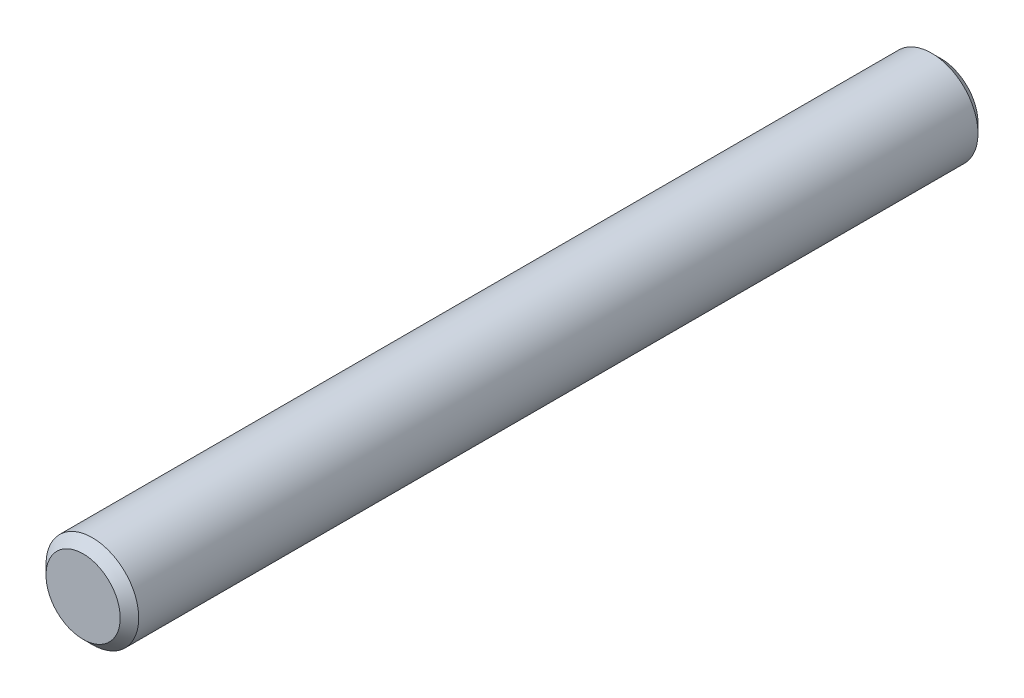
from build123d import *

# Parameters (mm, degrees)
ESQUISSE1_R      = 10
EXTRUSION1_DEPTH = 92.5
CHANFREIN1_SIZE  = 2


with BuildPart() as part:
    # Esquisse1 → Extrusion1 (new, symmetric)
    with BuildSketch(Plane.XY):
        Circle(ESQUISSE1_R)
    extrude(amount=EXTRUSION1_DEPTH, both=True)

    # Chanfrein1
    chanfrein1_edges = [part.edges().sort_by_distance(p)[0] for p in [
        (-10, 0, -92.5),
        (-10, 0, 92.5),
    ]]
    chamfer(chanfrein1_edges, length=CHANFREIN1_SIZE)


solid = part.part
